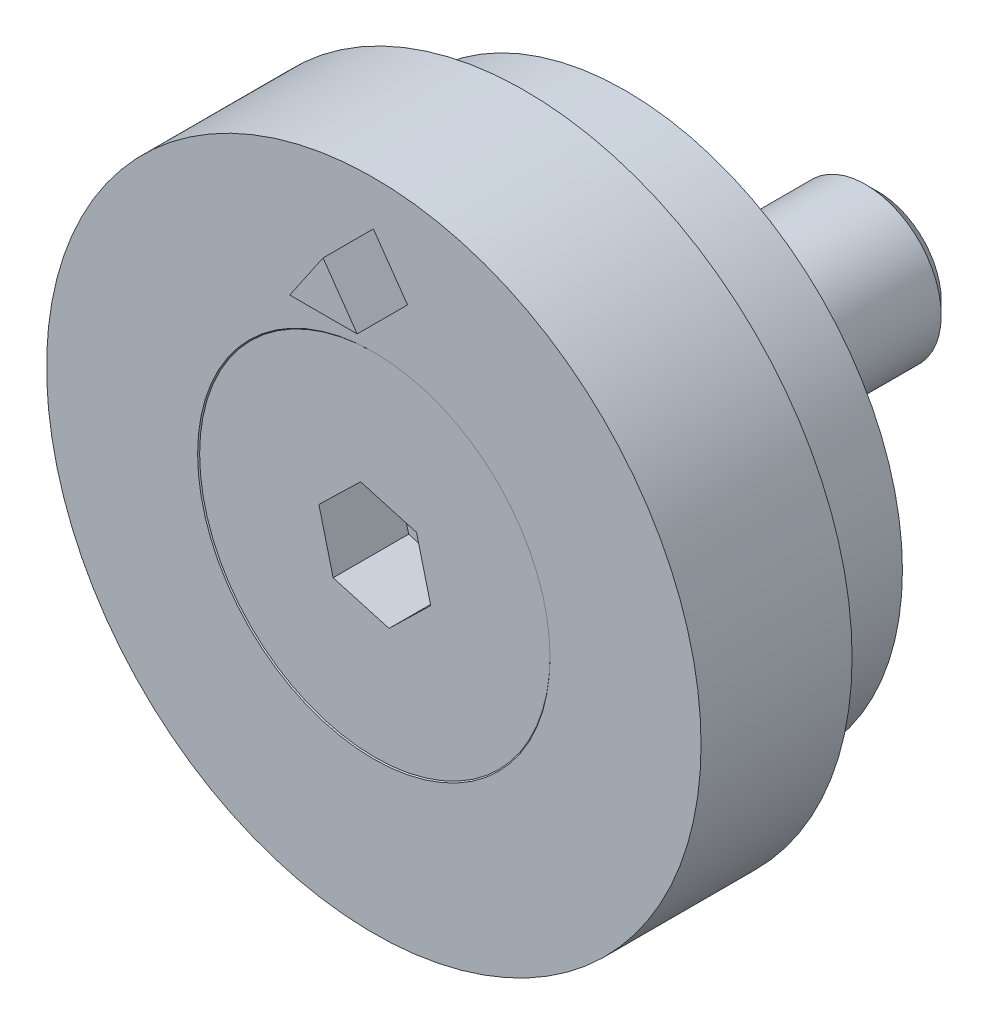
ISO-10303-21;
HEADER;
FILE_DESCRIPTION(('STEP AP214'),'2;1');
FILE_NAME('part.step','',(''),(''),'','','');
FILE_SCHEMA(('AUTOMOTIVE_DESIGN { 1 0 10303 214 1 1 1 1 }'));
ENDSEC;
DATA;
#1=APPLICATION_CONTEXT('core data for automotive mechanical design processes');
#2=APPLICATION_PROTOCOL_DEFINITION('international standard','automotive_design',2000,#1);
#3=PRODUCT_CONTEXT('',#1,'mechanical');
#4=PRODUCT('Part','Part','',(#3));
#5=PRODUCT_RELATED_PRODUCT_CATEGORY('part','',(#4));
#6=PRODUCT_DEFINITION_FORMATION('','',#4);
#7=PRODUCT_DEFINITION_CONTEXT('part definition',#1,'design');
#8=PRODUCT_DEFINITION('design','',#6,#7);
#9=PRODUCT_DEFINITION_SHAPE('','',#8);
#10=(LENGTH_UNIT() NAMED_UNIT(*) SI_UNIT(.MILLI.,.METRE.));
#11=(NAMED_UNIT(*) PLANE_ANGLE_UNIT() SI_UNIT($,.RADIAN.));
#12=(NAMED_UNIT(*) SI_UNIT($,.STERADIAN.) SOLID_ANGLE_UNIT());
#13=UNCERTAINTY_MEASURE_WITH_UNIT(LENGTH_MEASURE(1.E-05),#10,'distance_accuracy_value','');
#14=(GEOMETRIC_REPRESENTATION_CONTEXT(3) GLOBAL_UNCERTAINTY_ASSIGNED_CONTEXT((#13)) GLOBAL_UNIT_ASSIGNED_CONTEXT((#10,
#11,#12)) REPRESENTATION_CONTEXT('',''));
#15=CARTESIAN_POINT('',(0.,0.,0.));
#16=DIRECTION('',(0.,0.,1.));
#17=DIRECTION('',(1.,0.,0.));
#18=AXIS2_PLACEMENT_3D('',#15,#16,#17);
#19=CARTESIAN_POINT('',(0.,0.,-0.0200000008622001));
#20=DIRECTION('',(0.,0.,1.));
#21=DIRECTION('',(1.,0.,0.));
#22=AXIS2_PLACEMENT_3D('',#19,#20,#21);
#23=CYLINDRICAL_SURFACE('',#22,1.5);
#24=CARTESIAN_POINT('',(0.,0.,-2.0000000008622));
#25=DIRECTION('',(0.,0.,1.));
#26=DIRECTION('',(1.,0.,0.));
#27=AXIS2_PLACEMENT_3D('',#24,#25,#26);
#28=CIRCLE('',#27,1.5);
#29=CARTESIAN_POINT('',(1.5,0.,-2.0000000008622));
#30=VERTEX_POINT('',#29);
#31=EDGE_CURVE('P0_E11',#30,#30,#28,.T.);
#32=ORIENTED_EDGE('',*,*,#31,.F.);
#33=EDGE_LOOP('',(#32));
#34=FACE_BOUND('',#33,.T.);
#35=CARTESIAN_POINT('',(0.,0.,-9.7700000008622));
#36=DIRECTION('',(0.,0.,1.));
#37=DIRECTION('',(1.,0.,0.));
#38=AXIS2_PLACEMENT_3D('',#35,#36,#37);
#39=CIRCLE('',#38,1.5);
#40=CARTESIAN_POINT('',(1.5,0.,-9.7700000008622));
#41=VERTEX_POINT('',#40);
#42=EDGE_CURVE('P0_E136',#41,#41,#39,.T.);
#43=ORIENTED_EDGE('',*,*,#42,.T.);
#44=EDGE_LOOP('',(#43));
#45=FACE_BOUND('',#44,.T.);
#46=ADVANCED_FACE('P0_F35',(#34,#45),#23,.T.);
#47=CARTESIAN_POINT('',(0.,0.,-2.0000000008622));
#48=DIRECTION('',(0.,0.,1.));
#49=DIRECTION('',(1.,0.,0.));
#50=AXIS2_PLACEMENT_3D('',#47,#48,#49);
#51=CONICAL_SURFACE('',#50,1.5,0.785398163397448);
#52=CARTESIAN_POINT('',(0.,0.,-0.0200000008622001));
#53=DIRECTION('',(0.,0.,1.));
#54=DIRECTION('',(1.,0.,0.));
#55=AXIS2_PLACEMENT_3D('',#52,#53,#54);
#56=CIRCLE('',#55,3.48);
#57=CARTESIAN_POINT('',(3.48,0.,-0.0200000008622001));
#58=VERTEX_POINT('',#57);
#59=EDGE_CURVE('P0_E42',#58,#58,#56,.T.);
#60=ORIENTED_EDGE('',*,*,#59,.F.);
#61=EDGE_LOOP('',(#60));
#62=FACE_BOUND('',#61,.T.);
#63=ORIENTED_EDGE('',*,*,#31,.T.);
#64=EDGE_LOOP('',(#63));
#65=FACE_BOUND('',#64,.T.);
#66=ADVANCED_FACE('P0_F151',(#62,#65),#51,.T.);
#67=CARTESIAN_POINT('',(0.,3.48,-0.0200000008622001));
#68=DIRECTION('',(0.,0.,-1.));
#69=DIRECTION('',(-1.,0.,0.));
#70=AXIS2_PLACEMENT_3D('',#67,#68,#69);
#71=PLANE('',#70);
#72=DIRECTION('',(0.962144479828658,-0.272539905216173,0.));
#73=VECTOR('',#72,1.);
#74=CARTESIAN_POINT('',(-0.828034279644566,-0.804793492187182,-0.0200000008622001));
#75=LINE('',#74,#73);
#76=CARTESIAN_POINT('',(-0.828034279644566,-0.804793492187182,-0.0200000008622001));
#77=VERTEX_POINT('',#76);
#78=CARTESIAN_POINT('',(0.282954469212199,-1.11949546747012,-0.0200000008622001));
#79=VERTEX_POINT('',#78);
#80=EDGE_CURVE('P0_E123',#77,#79,#75,.T.);
#81=ORIENTED_EDGE('',*,*,#80,.F.);
#82=DIRECTION('',(0.245045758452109,-0.969511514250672,0.));
#83=VECTOR('',#82,1.);
#84=CARTESIAN_POINT('',(-1.11098874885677,0.314701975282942,-0.0200000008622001));
#85=LINE('',#84,#83);
#86=CARTESIAN_POINT('',(-1.11098874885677,0.314701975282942,-0.0200000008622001));
#87=VERTEX_POINT('',#86);
#88=EDGE_CURVE('P0_E49',#87,#77,#85,.T.);
#89=ORIENTED_EDGE('',*,*,#88,.F.);
#90=DIRECTION('',(-0.717098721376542,-0.696971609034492,0.));
#91=VECTOR('',#90,1.);
#92=CARTESIAN_POINT('',(-0.282954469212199,1.11949546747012,-0.0200000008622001));
#93=LINE('',#92,#91);
#94=CARTESIAN_POINT('',(-0.282954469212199,1.11949546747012,-0.0200000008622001));
#95=VERTEX_POINT('',#94);
#96=EDGE_CURVE('P0_E132',#95,#87,#93,.T.);
#97=ORIENTED_EDGE('',*,*,#96,.F.);
#98=DIRECTION('',(-0.962144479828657,0.272539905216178,0.));
#99=VECTOR('',#98,1.);
#100=CARTESIAN_POINT('',(0.828034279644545,0.804793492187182,-0.0200000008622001));
#101=LINE('',#100,#99);
#102=CARTESIAN_POINT('',(0.828034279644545,0.804793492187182,-0.0200000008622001));
#103=VERTEX_POINT('',#102);
#104=EDGE_CURVE('P0_E130',#103,#95,#101,.T.);
#105=ORIENTED_EDGE('',*,*,#104,.F.);
#106=DIRECTION('',(-0.245045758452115,0.96951151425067,0.));
#107=VECTOR('',#106,1.);
#108=CARTESIAN_POINT('',(1.11098874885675,-0.314701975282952,-0.0200000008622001));
#109=LINE('',#108,#107);
#110=CARTESIAN_POINT('',(1.11098874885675,-0.314701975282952,-0.0200000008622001));
#111=VERTEX_POINT('',#110);
#112=EDGE_CURVE('P0_E97',#111,#103,#109,.T.);
#113=ORIENTED_EDGE('',*,*,#112,.F.);
#114=DIRECTION('',(0.717098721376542,0.696971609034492,0.));
#115=VECTOR('',#114,1.);
#116=CARTESIAN_POINT('',(0.282954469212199,-1.11949546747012,-0.0200000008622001));
#117=LINE('',#116,#115);
#118=EDGE_CURVE('P0_E126',#79,#111,#117,.T.);
#119=ORIENTED_EDGE('',*,*,#118,.F.);
#120=EDGE_LOOP('',(#81,#89,#97,#105,#113,#119));
#121=FACE_BOUND('',#120,.T.);
#122=ORIENTED_EDGE('',*,*,#59,.T.);
#123=EDGE_LOOP('',(#122));
#124=FACE_BOUND('',#123,.T.);
#125=ADVANCED_FACE('P0_F149',(#121,#124),#71,.F.);
#126=CARTESIAN_POINT('',(0.,0.,-10.0200000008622));
#127=DIRECTION('',(0.,0.,1.));
#128=DIRECTION('',(1.,0.,0.));
#129=AXIS2_PLACEMENT_3D('',#126,#127,#128);
#130=PLANE('',#129);
#131=CARTESIAN_POINT('',(0.,0.,-10.0200000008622));
#132=DIRECTION('',(0.,0.,1.));
#133=DIRECTION('',(1.,0.,0.));
#134=AXIS2_PLACEMENT_3D('',#131,#132,#133);
#135=CIRCLE('',#134,1.25);
#136=CARTESIAN_POINT('',(1.25,0.,-10.0200000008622));
#137=VERTEX_POINT('',#136);
#138=EDGE_CURVE('P0_E144',#137,#137,#135,.T.);
#139=ORIENTED_EDGE('',*,*,#138,.F.);
#140=EDGE_LOOP('',(#139));
#141=FACE_BOUND('',#140,.T.);
#142=ADVANCED_FACE('P0_F164',(#141),#130,.F.);
#143=CARTESIAN_POINT('',(0.,0.,-10.0200000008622));
#144=DIRECTION('',(0.,0.,1.));
#145=DIRECTION('',(1.,0.,0.));
#146=AXIS2_PLACEMENT_3D('',#143,#144,#145);
#147=CONICAL_SURFACE('',#146,1.25,0.78539816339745);
#148=ORIENTED_EDGE('',*,*,#42,.F.);
#149=EDGE_LOOP('',(#148));
#150=FACE_BOUND('',#149,.T.);
#151=ORIENTED_EDGE('',*,*,#138,.T.);
#152=EDGE_LOOP('',(#151));
#153=FACE_BOUND('',#152,.T.);
#154=ADVANCED_FACE('P0_F160',(#150,#153),#147,.T.);
#155=CARTESIAN_POINT('',(-1.11098874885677,0.314701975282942,-1.5200000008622));
#156=DIRECTION('',(-0.969511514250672,-0.245045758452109,0.));
#157=DIRECTION('',(0.245045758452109,-0.969511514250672,0.));
#158=AXIS2_PLACEMENT_3D('',#155,#156,#157);
#159=PLANE('',#158);
#160=ORIENTED_EDGE('',*,*,#88,.T.);
#161=DIRECTION('',(0.,0.,1.));
#162=VECTOR('',#161,1.);
#163=CARTESIAN_POINT('',(-0.828034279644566,-0.804793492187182,-1.5200000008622));
#164=LINE('',#163,#162);
#165=CARTESIAN_POINT('',(-0.828034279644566,-0.804793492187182,-1.5200000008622));
#166=VERTEX_POINT('',#165);
#167=EDGE_CURVE('P0_E79',#166,#77,#164,.T.);
#168=ORIENTED_EDGE('',*,*,#167,.F.);
#169=DIRECTION('',(0.245045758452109,-0.969511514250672,0.));
#170=VECTOR('',#169,1.);
#171=CARTESIAN_POINT('',(-1.11098874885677,0.314701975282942,-1.5200000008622));
#172=LINE('',#171,#170);
#173=CARTESIAN_POINT('',(-1.11098874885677,0.314701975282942,-1.5200000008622));
#174=VERTEX_POINT('',#173);
#175=EDGE_CURVE('P0_E134',#174,#166,#172,.T.);
#176=ORIENTED_EDGE('',*,*,#175,.F.);
#177=DIRECTION('',(0.,0.,1.));
#178=VECTOR('',#177,1.);
#179=CARTESIAN_POINT('',(-1.11098874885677,0.314701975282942,-1.5200000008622));
#180=LINE('',#179,#178);
#181=EDGE_CURVE('P0_E57',#174,#87,#180,.T.);
#182=ORIENTED_EDGE('',*,*,#181,.T.);
#183=EDGE_LOOP('',(#160,#168,#176,#182));
#184=FACE_BOUND('',#183,.T.);
#185=ADVANCED_FACE('P0_F163',(#184),#159,.F.);
#186=CARTESIAN_POINT('',(-0.282954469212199,1.11949546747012,-1.5200000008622));
#187=DIRECTION('',(-0.696971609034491,0.717098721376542,0.));
#188=DIRECTION('',(-0.717098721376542,-0.696971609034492,0.));
#189=AXIS2_PLACEMENT_3D('',#186,#187,#188);
#190=PLANE('',#189);
#191=ORIENTED_EDGE('',*,*,#96,.T.);
#192=ORIENTED_EDGE('',*,*,#181,.F.);
#193=DIRECTION('',(-0.717098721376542,-0.696971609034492,0.));
#194=VECTOR('',#193,1.);
#195=CARTESIAN_POINT('',(-0.282954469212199,1.11949546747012,-1.5200000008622));
#196=LINE('',#195,#194);
#197=CARTESIAN_POINT('',(-0.282954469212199,1.11949546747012,-1.5200000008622));
#198=VERTEX_POINT('',#197);
#199=EDGE_CURVE('P0_E109',#198,#174,#196,.T.);
#200=ORIENTED_EDGE('',*,*,#199,.F.);
#201=DIRECTION('',(0.,0.,1.));
#202=VECTOR('',#201,1.);
#203=CARTESIAN_POINT('',(-0.282954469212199,1.11949546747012,-1.5200000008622));
#204=LINE('',#203,#202);
#205=EDGE_CURVE('P0_E101',#198,#95,#204,.T.);
#206=ORIENTED_EDGE('',*,*,#205,.T.);
#207=EDGE_LOOP('',(#191,#192,#200,#206));
#208=FACE_BOUND('',#207,.T.);
#209=ADVANCED_FACE('P0_F178',(#208),#190,.F.);
#210=CARTESIAN_POINT('',(0.828034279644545,0.804793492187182,-1.5200000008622));
#211=DIRECTION('',(0.272539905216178,0.962144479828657,0.));
#212=DIRECTION('',(-0.962144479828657,0.272539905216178,0.));
#213=AXIS2_PLACEMENT_3D('',#210,#211,#212);
#214=PLANE('',#213);
#215=ORIENTED_EDGE('',*,*,#104,.T.);
#216=ORIENTED_EDGE('',*,*,#205,.F.);
#217=DIRECTION('',(-0.962144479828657,0.272539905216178,0.));
#218=VECTOR('',#217,1.);
#219=CARTESIAN_POINT('',(0.828034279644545,0.804793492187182,-1.5200000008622));
#220=LINE('',#219,#218);
#221=CARTESIAN_POINT('',(0.828034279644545,0.804793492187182,-1.5200000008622));
#222=VERTEX_POINT('',#221);
#223=EDGE_CURVE('P0_E105',#222,#198,#220,.T.);
#224=ORIENTED_EDGE('',*,*,#223,.F.);
#225=DIRECTION('',(0.,0.,1.));
#226=VECTOR('',#225,1.);
#227=CARTESIAN_POINT('',(0.828034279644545,0.804793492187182,-1.5200000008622));
#228=LINE('',#227,#226);
#229=EDGE_CURVE('P0_E90',#222,#103,#228,.T.);
#230=ORIENTED_EDGE('',*,*,#229,.T.);
#231=EDGE_LOOP('',(#215,#216,#224,#230));
#232=FACE_BOUND('',#231,.T.);
#233=ADVANCED_FACE('P0_F106',(#232),#214,.F.);
#234=CARTESIAN_POINT('',(1.11098874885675,-0.314701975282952,-1.5200000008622));
#235=DIRECTION('',(0.96951151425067,0.245045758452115,0.));
#236=DIRECTION('',(-0.245045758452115,0.96951151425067,0.));
#237=AXIS2_PLACEMENT_3D('',#234,#235,#236);
#238=PLANE('',#237);
#239=ORIENTED_EDGE('',*,*,#112,.T.);
#240=ORIENTED_EDGE('',*,*,#229,.F.);
#241=DIRECTION('',(-0.245045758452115,0.96951151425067,0.));
#242=VECTOR('',#241,1.);
#243=CARTESIAN_POINT('',(1.11098874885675,-0.314701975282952,-1.5200000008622));
#244=LINE('',#243,#242);
#245=CARTESIAN_POINT('',(1.11098874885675,-0.314701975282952,-1.5200000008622));
#246=VERTEX_POINT('',#245);
#247=EDGE_CURVE('P0_E94',#246,#222,#244,.T.);
#248=ORIENTED_EDGE('',*,*,#247,.F.);
#249=DIRECTION('',(0.,0.,1.));
#250=VECTOR('',#249,1.);
#251=CARTESIAN_POINT('',(1.11098874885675,-0.314701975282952,-1.5200000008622));
#252=LINE('',#251,#250);
#253=EDGE_CURVE('P0_E102',#246,#111,#252,.T.);
#254=ORIENTED_EDGE('',*,*,#253,.T.);
#255=EDGE_LOOP('',(#239,#240,#248,#254));
#256=FACE_BOUND('',#255,.T.);
#257=ADVANCED_FACE('P0_F92',(#256),#238,.F.);
#258=CARTESIAN_POINT('',(0.282954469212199,-1.11949546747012,-1.5200000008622));
#259=DIRECTION('',(0.696971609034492,-0.717098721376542,0.));
#260=DIRECTION('',(0.717098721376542,0.696971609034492,0.));
#261=AXIS2_PLACEMENT_3D('',#258,#259,#260);
#262=PLANE('',#261);
#263=ORIENTED_EDGE('',*,*,#118,.T.);
#264=ORIENTED_EDGE('',*,*,#253,.F.);
#265=DIRECTION('',(0.717098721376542,0.696971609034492,0.));
#266=VECTOR('',#265,1.);
#267=CARTESIAN_POINT('',(0.282954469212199,-1.11949546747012,-1.5200000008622));
#268=LINE('',#267,#266);
#269=CARTESIAN_POINT('',(0.282954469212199,-1.11949546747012,-1.5200000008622));
#270=VERTEX_POINT('',#269);
#271=EDGE_CURVE('P0_E115',#270,#246,#268,.T.);
#272=ORIENTED_EDGE('',*,*,#271,.F.);
#273=DIRECTION('',(0.,0.,1.));
#274=VECTOR('',#273,1.);
#275=CARTESIAN_POINT('',(0.282954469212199,-1.11949546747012,-1.5200000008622));
#276=LINE('',#275,#274);
#277=EDGE_CURVE('P0_E139',#270,#79,#276,.T.);
#278=ORIENTED_EDGE('',*,*,#277,.T.);
#279=EDGE_LOOP('',(#263,#264,#272,#278));
#280=FACE_BOUND('',#279,.T.);
#281=ADVANCED_FACE('P0_F182',(#280),#262,.F.);
#282=CARTESIAN_POINT('',(-0.828034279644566,-0.804793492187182,-1.5200000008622));
#283=DIRECTION('',(-0.272539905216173,-0.962144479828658,0.));
#284=DIRECTION('',(0.962144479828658,-0.272539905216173,0.));
#285=AXIS2_PLACEMENT_3D('',#282,#283,#284);
#286=PLANE('',#285);
#287=ORIENTED_EDGE('',*,*,#80,.T.);
#288=ORIENTED_EDGE('',*,*,#277,.F.);
#289=DIRECTION('',(0.962144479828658,-0.272539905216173,0.));
#290=VECTOR('',#289,1.);
#291=CARTESIAN_POINT('',(-0.828034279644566,-0.804793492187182,-1.5200000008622));
#292=LINE('',#291,#290);
#293=EDGE_CURVE('P0_E117',#166,#270,#292,.T.);
#294=ORIENTED_EDGE('',*,*,#293,.F.);
#295=ORIENTED_EDGE('',*,*,#167,.T.);
#296=EDGE_LOOP('',(#287,#288,#294,#295));
#297=FACE_BOUND('',#296,.T.);
#298=ADVANCED_FACE('P0_F179',(#297),#286,.F.);
#299=CARTESIAN_POINT('',(0.,0.,-1.5200000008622));
#300=DIRECTION('',(0.,0.,1.));
#301=DIRECTION('',(1.,0.,0.));
#302=AXIS2_PLACEMENT_3D('',#299,#300,#301);
#303=PLANE('',#302);
#304=ORIENTED_EDGE('',*,*,#175,.T.);
#305=ORIENTED_EDGE('',*,*,#293,.T.);
#306=ORIENTED_EDGE('',*,*,#271,.T.);
#307=ORIENTED_EDGE('',*,*,#247,.T.);
#308=ORIENTED_EDGE('',*,*,#223,.T.);
#309=ORIENTED_EDGE('',*,*,#199,.T.);
#310=EDGE_LOOP('',(#304,#305,#306,#307,#308,#309));
#311=FACE_BOUND('',#310,.T.);
#312=ADVANCED_FACE('P0_F112',(#311),#303,.T.);
#313=CLOSED_SHELL('',(#46,#66,#125,#142,#154,#185,#209,#233,#257,#281,#298,#312));
#314=MANIFOLD_SOLID_BREP('P0_B2',#313);
#315=CARTESIAN_POINT('',(0.,6.5,0.));
#316=DIRECTION('',(0.,0.,-1.));
#317=DIRECTION('',(-1.,0.,0.));
#318=AXIS2_PLACEMENT_3D('',#315,#316,#317);
#319=PLANE('',#318);
#320=CARTESIAN_POINT('',(0.,0.,0.));
#321=DIRECTION('',(0.,0.,1.));
#322=DIRECTION('',(1.,0.,0.));
#323=AXIS2_PLACEMENT_3D('',#320,#321,#322);
#324=CIRCLE('',#323,6.5);
#325=CARTESIAN_POINT('',(6.5,0.,0.));
#326=VERTEX_POINT('',#325);
#327=EDGE_CURVE('P1_E11',#326,#326,#324,.T.);
#328=ORIENTED_EDGE('',*,*,#327,.T.);
#329=EDGE_LOOP('',(#328));
#330=FACE_BOUND('',#329,.T.);
#331=CARTESIAN_POINT('',(0.,0.,0.));
#332=DIRECTION('',(0.,0.,1.));
#333=DIRECTION('',(1.,0.,0.));
#334=AXIS2_PLACEMENT_3D('',#331,#332,#333);
#335=CIRCLE('',#334,3.5000000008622);
#336=CARTESIAN_POINT('',(3.5000000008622,0.,0.));
#337=VERTEX_POINT('',#336);
#338=EDGE_CURVE('P1_E24',#337,#337,#335,.T.);
#339=ORIENTED_EDGE('',*,*,#338,.F.);
#340=EDGE_LOOP('',(#339));
#341=FACE_BOUND('',#340,.T.);
#342=DIRECTION('',(1.,0.,0.));
#343=VECTOR('',#342,1.);
#344=CARTESIAN_POINT('',(-0.669362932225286,4.6482,0.));
#345=LINE('',#344,#343);
#346=CARTESIAN_POINT('',(-0.669362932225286,4.6482,0.));
#347=VERTEX_POINT('',#346);
#348=CARTESIAN_POINT('',(0.669362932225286,4.6482,0.));
#349=VERTEX_POINT('',#348);
#350=EDGE_CURVE('P1_E68',#347,#349,#345,.T.);
#351=ORIENTED_EDGE('',*,*,#350,.F.);
#352=DIRECTION('',(-0.563573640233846,-0.826065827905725,0.));
#353=VECTOR('',#352,1.);
#354=CARTESIAN_POINT('',(-0.00870054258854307,5.616575,0.));
#355=LINE('',#354,#353);
#356=CARTESIAN_POINT('',(-0.00870054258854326,5.616575,0.));
#357=VERTEX_POINT('',#356);
#358=EDGE_CURVE('P1_E35',#357,#347,#355,.T.);
#359=ORIENTED_EDGE('',*,*,#358,.F.);
#360=DIRECTION('',(-0.573576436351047,0.819152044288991,0.));
#361=VECTOR('',#360,1.);
#362=CARTESIAN_POINT('',(0.669362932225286,4.6482,0.));
#363=LINE('',#362,#361);
#364=EDGE_CURVE('P1_E31',#349,#357,#363,.T.);
#365=ORIENTED_EDGE('',*,*,#364,.F.);
#366=EDGE_LOOP('',(#351,#359,#365));
#367=FACE_BOUND('',#366,.T.);
#368=ADVANCED_FACE('P1_F16',(#330,#341,#367),#319,.F.);
#369=CARTESIAN_POINT('',(0.,0.,3.12219627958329));
#370=DIRECTION('',(0.,0.,1.));
#371=DIRECTION('',(1.,0.,0.));
#372=AXIS2_PLACEMENT_3D('',#369,#370,#371);
#373=CYLINDRICAL_SURFACE('',#372,6.5);
#374=ORIENTED_EDGE('',*,*,#327,.F.);
#375=EDGE_LOOP('',(#374));
#376=FACE_BOUND('',#375,.T.);
#377=CARTESIAN_POINT('',(0.,0.,-3.));
#378=DIRECTION('',(0.,0.,1.));
#379=DIRECTION('',(1.,0.,0.));
#380=AXIS2_PLACEMENT_3D('',#377,#378,#379);
#381=CIRCLE('',#380,6.5);
#382=CARTESIAN_POINT('',(6.5,0.,-3.));
#383=VERTEX_POINT('',#382);
#384=EDGE_CURVE('P1_E69',#383,#383,#381,.T.);
#385=ORIENTED_EDGE('',*,*,#384,.T.);
#386=EDGE_LOOP('',(#385));
#387=FACE_BOUND('',#386,.T.);
#388=ADVANCED_FACE('P1_F18',(#376,#387),#373,.T.);
#389=CARTESIAN_POINT('',(0.,0.,0.));
#390=DIRECTION('',(0.,0.,1.));
#391=DIRECTION('',(1.,0.,0.));
#392=AXIS2_PLACEMENT_3D('',#389,#390,#391);
#393=CONICAL_SURFACE('',#392,3.5000000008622,0.785398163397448);
#394=CARTESIAN_POINT('',(0.,0.,-2.0000000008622));
#395=DIRECTION('',(0.,0.,1.));
#396=DIRECTION('',(1.,0.,0.));
#397=AXIS2_PLACEMENT_3D('',#394,#395,#396);
#398=CIRCLE('',#397,1.5);
#399=CARTESIAN_POINT('',(1.5,0.,-2.0000000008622));
#400=VERTEX_POINT('',#399);
#401=EDGE_CURVE('P1_E86',#400,#400,#398,.T.);
#402=ORIENTED_EDGE('',*,*,#401,.F.);
#403=EDGE_LOOP('',(#402));
#404=FACE_BOUND('',#403,.T.);
#405=ORIENTED_EDGE('',*,*,#338,.T.);
#406=EDGE_LOOP('',(#405));
#407=FACE_BOUND('',#406,.T.);
#408=ADVANCED_FACE('P1_F91',(#404,#407),#393,.F.);
#409=CARTESIAN_POINT('',(0.,0.,3.12219627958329));
#410=DIRECTION('',(0.,0.,1.));
#411=DIRECTION('',(1.,0.,0.));
#412=AXIS2_PLACEMENT_3D('',#409,#410,#411);
#413=CYLINDRICAL_SURFACE('',#412,1.5);
#414=CARTESIAN_POINT('',(0.,0.,-5.));
#415=DIRECTION('',(0.,0.,1.));
#416=DIRECTION('',(1.,0.,0.));
#417=AXIS2_PLACEMENT_3D('',#414,#415,#416);
#418=CIRCLE('',#417,1.5);
#419=CARTESIAN_POINT('',(1.5,0.,-5.));
#420=VERTEX_POINT('',#419);
#421=EDGE_CURVE('P1_E83',#420,#420,#418,.T.);
#422=ORIENTED_EDGE('',*,*,#421,.F.);
#423=EDGE_LOOP('',(#422));
#424=FACE_BOUND('',#423,.T.);
#425=ORIENTED_EDGE('',*,*,#401,.T.);
#426=EDGE_LOOP('',(#425));
#427=FACE_BOUND('',#426,.T.);
#428=ADVANCED_FACE('P1_F125',(#424,#427),#413,.F.);
#429=CARTESIAN_POINT('',(0.,1.5,-5.));
#430=DIRECTION('',(0.,0.,1.));
#431=DIRECTION('',(1.,0.,0.));
#432=AXIS2_PLACEMENT_3D('',#429,#430,#431);
#433=PLANE('',#432);
#434=CARTESIAN_POINT('',(0.,0.,-5.));
#435=DIRECTION('',(0.,0.,1.));
#436=DIRECTION('',(1.,0.,0.));
#437=AXIS2_PLACEMENT_3D('',#434,#435,#436);
#438=CIRCLE('',#437,5.5);
#439=CARTESIAN_POINT('',(5.5,0.,-5.));
#440=VERTEX_POINT('',#439);
#441=EDGE_CURVE('P1_E80',#440,#440,#438,.T.);
#442=ORIENTED_EDGE('',*,*,#441,.F.);
#443=EDGE_LOOP('',(#442));
#444=FACE_BOUND('',#443,.T.);
#445=ORIENTED_EDGE('',*,*,#421,.T.);
#446=EDGE_LOOP('',(#445));
#447=FACE_BOUND('',#446,.T.);
#448=ADVANCED_FACE('P1_F121',(#444,#447),#433,.F.);
#449=CARTESIAN_POINT('',(0.,0.,3.12219627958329));
#450=DIRECTION('',(0.,0.,1.));
#451=DIRECTION('',(1.,0.,0.));
#452=AXIS2_PLACEMENT_3D('',#449,#450,#451);
#453=CYLINDRICAL_SURFACE('',#452,5.5);
#454=CARTESIAN_POINT('',(0.,0.,-3.));
#455=DIRECTION('',(0.,0.,1.));
#456=DIRECTION('',(1.,0.,0.));
#457=AXIS2_PLACEMENT_3D('',#454,#455,#456);
#458=CIRCLE('',#457,5.5);
#459=CARTESIAN_POINT('',(5.5,0.,-3.));
#460=VERTEX_POINT('',#459);
#461=EDGE_CURVE('P1_E72',#460,#460,#458,.T.);
#462=ORIENTED_EDGE('',*,*,#461,.F.);
#463=EDGE_LOOP('',(#462));
#464=FACE_BOUND('',#463,.T.);
#465=ORIENTED_EDGE('',*,*,#441,.T.);
#466=EDGE_LOOP('',(#465));
#467=FACE_BOUND('',#466,.T.);
#468=ADVANCED_FACE('P1_F117',(#464,#467),#453,.T.);
#469=CARTESIAN_POINT('',(0.,5.5,-3.));
#470=DIRECTION('',(0.,0.,1.));
#471=DIRECTION('',(1.,0.,0.));
#472=AXIS2_PLACEMENT_3D('',#469,#470,#471);
#473=PLANE('',#472);
#474=ORIENTED_EDGE('',*,*,#384,.F.);
#475=EDGE_LOOP('',(#474));
#476=FACE_BOUND('',#475,.T.);
#477=ORIENTED_EDGE('',*,*,#461,.T.);
#478=EDGE_LOOP('',(#477));
#479=FACE_BOUND('',#478,.T.);
#480=ADVANCED_FACE('P1_F114',(#476,#479),#473,.F.);
#481=CARTESIAN_POINT('',(-0.669362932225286,4.6482,1.));
#482=DIRECTION('',(0.,1.,0.));
#483=DIRECTION('',(0.,0.,1.));
#484=AXIS2_PLACEMENT_3D('',#481,#482,#483);
#485=PLANE('',#484);
#486=ORIENTED_EDGE('',*,*,#350,.T.);
#487=DIRECTION('',(0.,0.,-1.));
#488=VECTOR('',#487,1.);
#489=CARTESIAN_POINT('',(0.669362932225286,4.6482,1.));
#490=LINE('',#489,#488);
#491=CARTESIAN_POINT('',(0.669362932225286,4.6482,1.));
#492=VERTEX_POINT('',#491);
#493=EDGE_CURVE('P1_E52',#492,#349,#490,.T.);
#494=ORIENTED_EDGE('',*,*,#493,.F.);
#495=DIRECTION('',(1.,0.,0.));
#496=VECTOR('',#495,1.);
#497=CARTESIAN_POINT('',(-0.669362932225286,4.6482,1.));
#498=LINE('',#497,#496);
#499=CARTESIAN_POINT('',(-0.669362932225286,4.6482,1.));
#500=VERTEX_POINT('',#499);
#501=EDGE_CURVE('P1_E59',#500,#492,#498,.T.);
#502=ORIENTED_EDGE('',*,*,#501,.F.);
#503=DIRECTION('',(0.,0.,-1.));
#504=VECTOR('',#503,1.);
#505=CARTESIAN_POINT('',(-0.669362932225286,4.6482,1.));
#506=LINE('',#505,#504);
#507=EDGE_CURVE('P1_E74',#500,#347,#506,.T.);
#508=ORIENTED_EDGE('',*,*,#507,.T.);
#509=EDGE_LOOP('',(#486,#494,#502,#508));
#510=FACE_BOUND('',#509,.T.);
#511=ADVANCED_FACE('P1_F67',(#510),#485,.F.);
#512=CARTESIAN_POINT('',(0.669362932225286,4.6482,1.));
#513=DIRECTION('',(-0.819152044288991,-0.573576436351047,0.));
#514=DIRECTION('',(0.573576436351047,-0.819152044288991,0.));
#515=AXIS2_PLACEMENT_3D('',#512,#513,#514);
#516=PLANE('',#515);
#517=ORIENTED_EDGE('',*,*,#364,.T.);
#518=DIRECTION('',(0.,0.,-1.));
#519=VECTOR('',#518,1.);
#520=CARTESIAN_POINT('',(-0.00870054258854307,5.616575,1.));
#521=LINE('',#520,#519);
#522=CARTESIAN_POINT('',(-0.00870054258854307,5.616575,1.));
#523=VERTEX_POINT('',#522);
#524=EDGE_CURVE('P1_E55',#523,#357,#521,.T.);
#525=ORIENTED_EDGE('',*,*,#524,.F.);
#526=DIRECTION('',(-0.573576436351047,0.819152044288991,0.));
#527=VECTOR('',#526,1.);
#528=CARTESIAN_POINT('',(0.669362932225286,4.6482,1.));
#529=LINE('',#528,#527);
#530=EDGE_CURVE('P1_E48',#492,#523,#529,.T.);
#531=ORIENTED_EDGE('',*,*,#530,.F.);
#532=ORIENTED_EDGE('',*,*,#493,.T.);
#533=EDGE_LOOP('',(#517,#525,#531,#532));
#534=FACE_BOUND('',#533,.T.);
#535=ADVANCED_FACE('P1_F50',(#534),#516,.F.);
#536=CARTESIAN_POINT('',(-0.00870054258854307,5.616575,1.));
#537=DIRECTION('',(0.826065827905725,-0.563573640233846,0.));
#538=DIRECTION('',(0.563573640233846,0.826065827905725,0.));
#539=AXIS2_PLACEMENT_3D('',#536,#537,#538);
#540=PLANE('',#539);
#541=ORIENTED_EDGE('',*,*,#358,.T.);
#542=ORIENTED_EDGE('',*,*,#507,.F.);
#543=DIRECTION('',(-0.563573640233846,-0.826065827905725,0.));
#544=VECTOR('',#543,1.);
#545=CARTESIAN_POINT('',(-0.00870054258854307,5.616575,1.));
#546=LINE('',#545,#544);
#547=EDGE_CURVE('P1_E58',#523,#500,#546,.T.);
#548=ORIENTED_EDGE('',*,*,#547,.F.);
#549=ORIENTED_EDGE('',*,*,#524,.T.);
#550=EDGE_LOOP('',(#541,#542,#548,#549));
#551=FACE_BOUND('',#550,.T.);
#552=ADVANCED_FACE('P1_F97',(#551),#540,.F.);
#553=CARTESIAN_POINT('',(-0.669362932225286,4.6482,1.));
#554=DIRECTION('',(0.,0.,-1.));
#555=DIRECTION('',(-1.,0.,0.));
#556=AXIS2_PLACEMENT_3D('',#553,#554,#555);
#557=PLANE('',#556);
#558=ORIENTED_EDGE('',*,*,#501,.T.);
#559=ORIENTED_EDGE('',*,*,#530,.T.);
#560=ORIENTED_EDGE('',*,*,#547,.T.);
#561=EDGE_LOOP('',(#558,#559,#560));
#562=FACE_BOUND('',#561,.T.);
#563=ADVANCED_FACE('P1_F62',(#562),#557,.F.);
#564=CLOSED_SHELL('',(#368,#388,#408,#428,#448,#468,#480,#511,#535,#552,#563));
#565=MANIFOLD_SOLID_BREP('P1_B1',#564);
#566=ADVANCED_BREP_SHAPE_REPRESENTATION('',(#18,#314,#565),#14);
#567=SHAPE_DEFINITION_REPRESENTATION(#9,#566);
ENDSEC;
END-ISO-10303-21;
